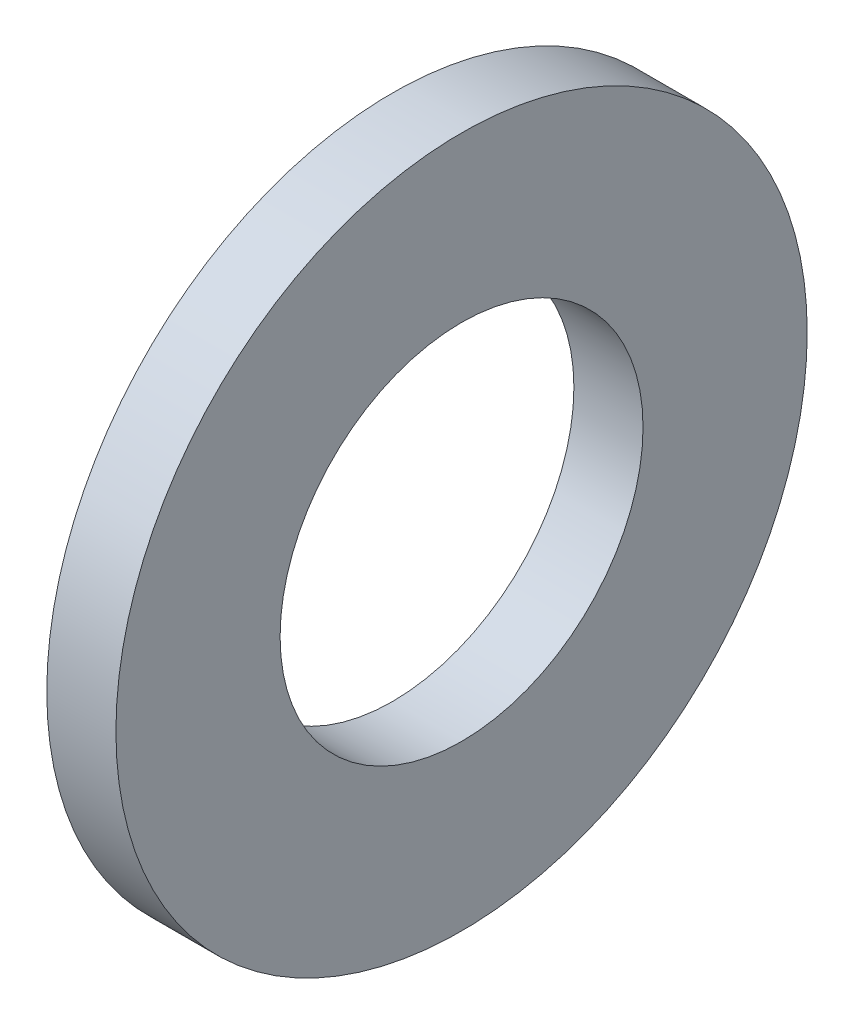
from build123d import *

# Parameters (mm, degrees)
SKETCH1_W = 1.6
SKETCH1_H = 3.8


with BuildPart() as part:
    # Sketch1 → Base-Revolve (revolve)
    with BuildSketch(Plane.XY, mode=Mode.PRIVATE) as base_revolve_sk:
        with Locations((-0.8, 6.1)):
            Rectangle(SKETCH1_W, SKETCH1_H)
    revolve(base_revolve_sk.sketch.rotate(Axis((-34.925, 0, 0), (1, 0, 0)), 90), axis=Axis((-34.925, 0, 0), (1, 0, 0)))


solid = part.part
